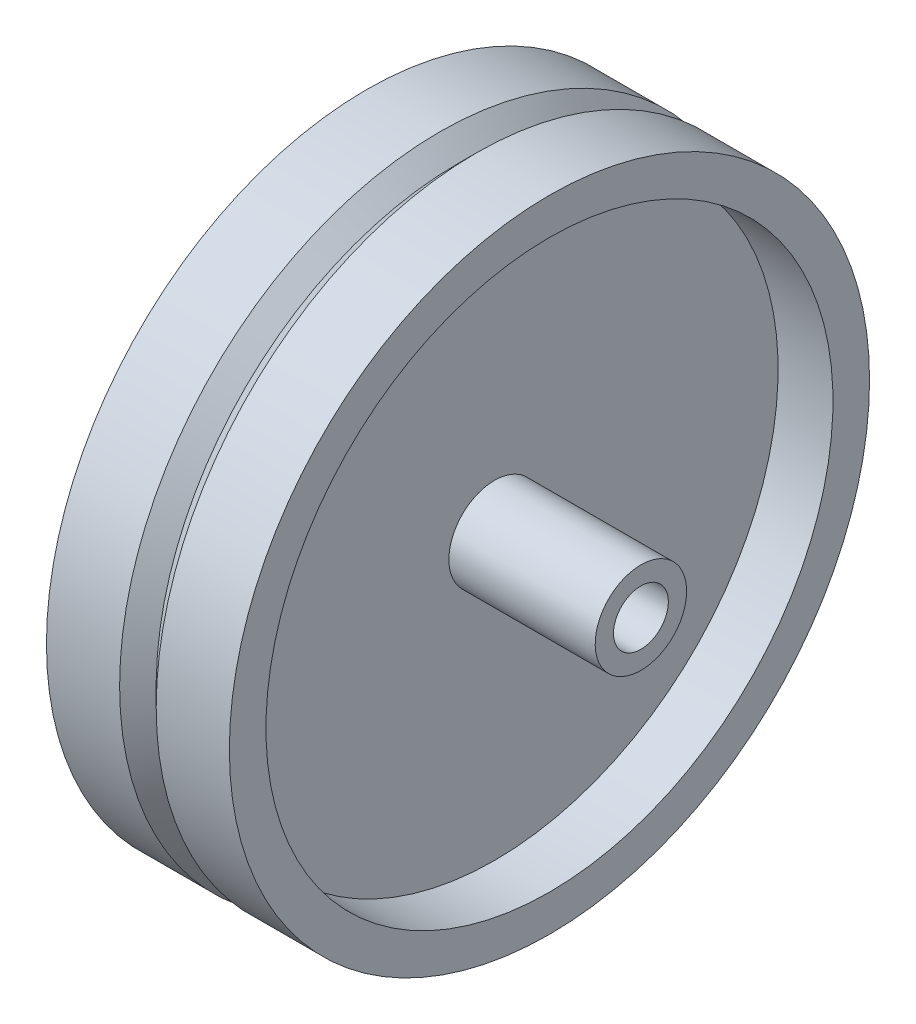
from build123d import *


with BuildPart() as part:
    # Sketch1 → Revolve1 (revolve)
    with BuildSketch(Plane.XY):
        Polygon((-1, 0), (-1, 2), (5, 2), (5, 28), (-1, 28), (-1, 32), (7, 32), (9, 30), (11, 32), (19, 32), (19, 28), (13, 28), (13, 2), (19, 2), (29, 2), (29, 0), align=None)
    revolve(axis=Axis((29, -3, 0), (-1, 0, 0)))


solid = part.part
